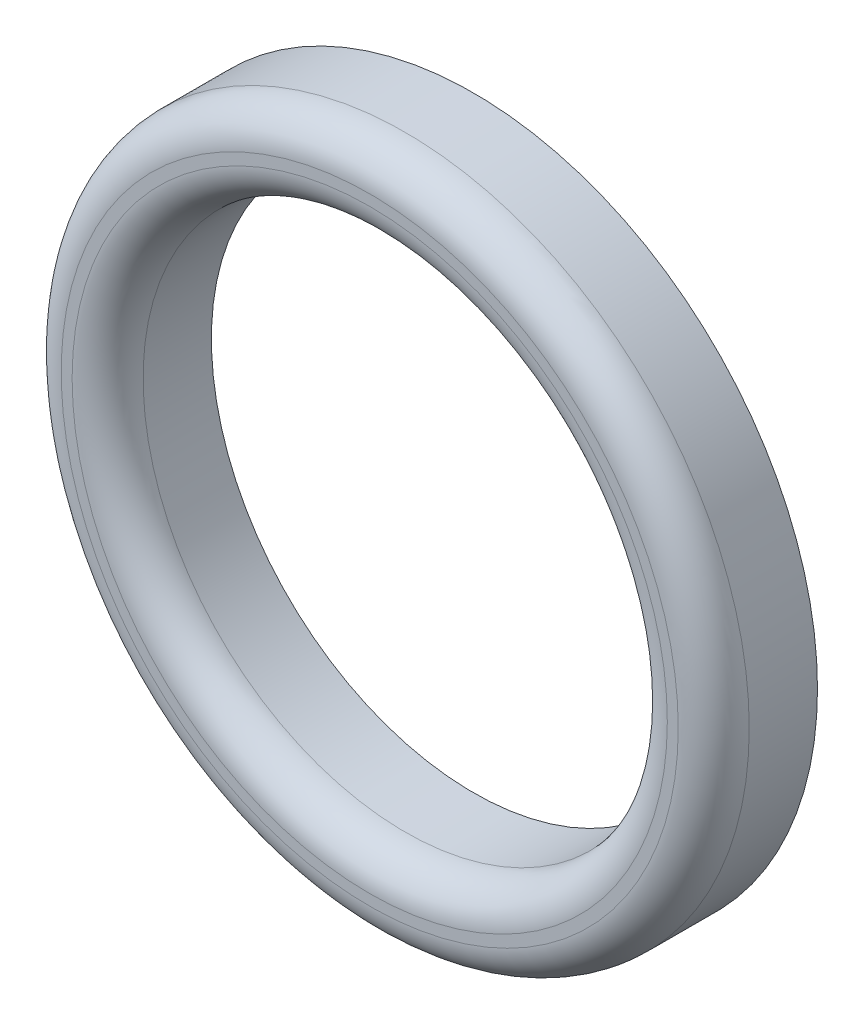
from build123d import *

# Parameters (mm, degrees)
SKETCH1_R           = 15.75
SKETCH1_R_2         = 12
BOSS_EXTRUDE1_DEPTH = 4.75
FILLET1_R           = 1.625


with BuildPart() as part:
    # Sketch1 → Boss-Extrude1 (new body)
    with BuildSketch(Plane.XY):
        Circle(SKETCH1_R)
        Circle(SKETCH1_R_2, mode=Mode.SUBTRACT)
    extrude(amount=BOSS_EXTRUDE1_DEPTH)

    # Fillet1
    fillet1_edges = [part.edges().sort_by_distance(p)[0] for p in [
        (-15.75, 0, 4.75),
        (-12, 0, 4.75),
    ]]
    fillet(fillet1_edges, radius=FILLET1_R)


solid = part.part
